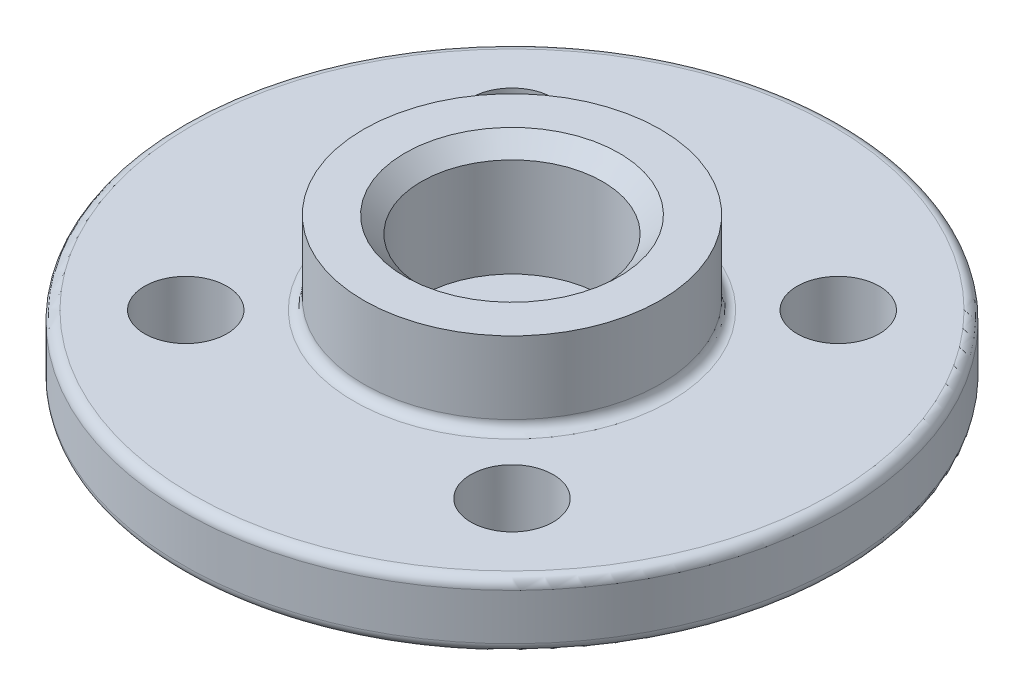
ISO-10303-21;
HEADER;
FILE_DESCRIPTION(('STEP AP214'),'2;1');
FILE_NAME('part.step','',(''),(''),'','','');
FILE_SCHEMA(('AUTOMOTIVE_DESIGN { 1 0 10303 214 1 1 1 1 }'));
ENDSEC;
DATA;
#1=APPLICATION_CONTEXT('core data for automotive mechanical design processes');
#2=APPLICATION_PROTOCOL_DEFINITION('international standard','automotive_design',2000,#1);
#3=PRODUCT_CONTEXT('',#1,'mechanical');
#4=PRODUCT('Part','Part','',(#3));
#5=PRODUCT_RELATED_PRODUCT_CATEGORY('part','',(#4));
#6=PRODUCT_DEFINITION_FORMATION('','',#4);
#7=PRODUCT_DEFINITION_CONTEXT('part definition',#1,'design');
#8=PRODUCT_DEFINITION('design','',#6,#7);
#9=PRODUCT_DEFINITION_SHAPE('','',#8);
#10=(LENGTH_UNIT() NAMED_UNIT(*) SI_UNIT(.MILLI.,.METRE.));
#11=(NAMED_UNIT(*) PLANE_ANGLE_UNIT() SI_UNIT($,.RADIAN.));
#12=(NAMED_UNIT(*) SI_UNIT($,.STERADIAN.) SOLID_ANGLE_UNIT());
#13=UNCERTAINTY_MEASURE_WITH_UNIT(LENGTH_MEASURE(1.E-05),#10,'distance_accuracy_value','');
#14=(GEOMETRIC_REPRESENTATION_CONTEXT(3) GLOBAL_UNCERTAINTY_ASSIGNED_CONTEXT((#13)) GLOBAL_UNIT_ASSIGNED_CONTEXT((#10,
#11,#12)) REPRESENTATION_CONTEXT('',''));
#15=CARTESIAN_POINT('',(0.,0.,0.));
#16=DIRECTION('',(0.,0.,1.));
#17=DIRECTION('',(1.,0.,0.));
#18=AXIS2_PLACEMENT_3D('',#15,#16,#17);
#19=CARTESIAN_POINT('',(0.,0.,0.));
#20=DIRECTION('',(0.,-1.,0.));
#21=DIRECTION('',(1.,0.,0.));
#22=AXIS2_PLACEMENT_3D('',#19,#20,#21);
#23=PLANE('',#22);
#24=CARTESIAN_POINT('',(0.,0.,0.));
#25=DIRECTION('',(0.,-1.,0.));
#26=DIRECTION('',(1.,0.,0.));
#27=AXIS2_PLACEMENT_3D('',#24,#25,#26);
#28=CIRCLE('',#27,9.7);
#29=CARTESIAN_POINT('',(9.7,0.,0.));
#30=VERTEX_POINT('',#29);
#31=EDGE_CURVE('E10',#30,#30,#28,.T.);
#32=ORIENTED_EDGE('',*,*,#31,.T.);
#33=EDGE_LOOP('',(#32));
#34=FACE_BOUND('',#33,.T.);
#35=CARTESIAN_POINT('',(4.94974746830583,0.,4.94974746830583));
#36=DIRECTION('',(0.,-1.,0.));
#37=DIRECTION('',(1.,0.,0.));
#38=AXIS2_PLACEMENT_3D('',#35,#36,#37);
#39=CIRCLE('',#38,1.45);
#40=CARTESIAN_POINT('',(6.39974746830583,0.,4.94974746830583));
#41=VERTEX_POINT('',#40);
#42=EDGE_CURVE('E87',#41,#41,#39,.F.);
#43=ORIENTED_EDGE('',*,*,#42,.T.);
#44=EDGE_LOOP('',(#43));
#45=FACE_BOUND('',#44,.T.);
#46=CARTESIAN_POINT('',(4.94974746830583,0.,-4.94974746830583));
#47=DIRECTION('',(0.,-1.,0.));
#48=DIRECTION('',(1.,0.,0.));
#49=AXIS2_PLACEMENT_3D('',#46,#47,#48);
#50=CIRCLE('',#49,1.45);
#51=CARTESIAN_POINT('',(6.39974746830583,0.,-4.94974746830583));
#52=VERTEX_POINT('',#51);
#53=EDGE_CURVE('E91',#52,#52,#50,.F.);
#54=ORIENTED_EDGE('',*,*,#53,.T.);
#55=EDGE_LOOP('',(#54));
#56=FACE_BOUND('',#55,.T.);
#57=CARTESIAN_POINT('',(-4.94974746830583,0.,4.94974746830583));
#58=DIRECTION('',(0.,-1.,0.));
#59=DIRECTION('',(1.,0.,0.));
#60=AXIS2_PLACEMENT_3D('',#57,#58,#59);
#61=CIRCLE('',#60,1.45);
#62=CARTESIAN_POINT('',(-3.49974746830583,0.,4.94974746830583));
#63=VERTEX_POINT('',#62);
#64=EDGE_CURVE('E95',#63,#63,#61,.F.);
#65=ORIENTED_EDGE('',*,*,#64,.T.);
#66=EDGE_LOOP('',(#65));
#67=FACE_BOUND('',#66,.T.);
#68=CARTESIAN_POINT('',(-4.94974746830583,0.,-4.94974746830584));
#69=DIRECTION('',(0.,-1.,0.));
#70=DIRECTION('',(1.,0.,0.));
#71=AXIS2_PLACEMENT_3D('',#68,#69,#70);
#72=CIRCLE('',#71,1.45);
#73=CARTESIAN_POINT('',(-3.49974746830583,0.,-4.94974746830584));
#74=VERTEX_POINT('',#73);
#75=EDGE_CURVE('E99',#74,#74,#72,.F.);
#76=ORIENTED_EDGE('',*,*,#75,.T.);
#77=EDGE_LOOP('',(#76));
#78=FACE_BOUND('',#77,.T.);
#79=CARTESIAN_POINT('',(0.,0.,0.));
#80=DIRECTION('',(0.,-1.,0.));
#81=DIRECTION('',(1.,0.,0.));
#82=AXIS2_PLACEMENT_3D('',#79,#80,#81);
#83=CIRCLE('',#82,1.5);
#84=CARTESIAN_POINT('',(1.5,0.,0.));
#85=VERTEX_POINT('',#84);
#86=EDGE_CURVE('E129',#85,#85,#83,.T.);
#87=ORIENTED_EDGE('',*,*,#86,.F.);
#88=EDGE_LOOP('',(#87));
#89=FACE_BOUND('',#88,.T.);
#90=ADVANCED_FACE('F43',(#34,#45,#56,#67,#78,#89),#23,.T.);
#91=CARTESIAN_POINT('',(0.,1.,0.));
#92=DIRECTION('',(0.,1.,0.));
#93=DIRECTION('',(-1.,0.,0.));
#94=AXIS2_PLACEMENT_3D('',#91,#92,#93);
#95=CYLINDRICAL_SURFACE('',#94,10.);
#96=CARTESIAN_POINT('',(0.,1.7,0.));
#97=DIRECTION('',(0.,1.,0.));
#98=DIRECTION('',(-1.,0.,0.));
#99=AXIS2_PLACEMENT_3D('',#96,#97,#98);
#100=CIRCLE('',#99,10.);
#101=CARTESIAN_POINT('',(-10.,1.7,0.));
#102=VERTEX_POINT('',#101);
#103=EDGE_CURVE('E51',#102,#102,#100,.F.);
#104=ORIENTED_EDGE('',*,*,#103,.T.);
#105=EDGE_LOOP('',(#104));
#106=FACE_BOUND('',#105,.T.);
#107=CARTESIAN_POINT('',(0.,0.3,0.));
#108=DIRECTION('',(0.,-1.,0.));
#109=DIRECTION('',(1.,0.,0.));
#110=AXIS2_PLACEMENT_3D('',#107,#108,#109);
#111=CIRCLE('',#110,10.);
#112=CARTESIAN_POINT('',(10.,0.299999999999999,0.));
#113=VERTEX_POINT('',#112);
#114=EDGE_CURVE('E56',#113,#113,#111,.F.);
#115=ORIENTED_EDGE('',*,*,#114,.T.);
#116=EDGE_LOOP('',(#115));
#117=FACE_BOUND('',#116,.T.);
#118=ADVANCED_FACE('F151',(#106,#117),#95,.T.);
#119=CARTESIAN_POINT('',(-10.,2.,0.));
#120=DIRECTION('',(0.,1.,0.));
#121=DIRECTION('',(-1.,0.,0.));
#122=AXIS2_PLACEMENT_3D('',#119,#120,#121);
#123=PLANE('',#122);
#124=CARTESIAN_POINT('',(0.,2.,0.));
#125=DIRECTION('',(0.,1.,0.));
#126=DIRECTION('',(-1.,0.,0.));
#127=AXIS2_PLACEMENT_3D('',#124,#125,#126);
#128=CIRCLE('',#127,4.8);
#129=CARTESIAN_POINT('',(-4.8,2.,0.));
#130=VERTEX_POINT('',#129);
#131=EDGE_CURVE('E61',#130,#130,#128,.F.);
#132=ORIENTED_EDGE('',*,*,#131,.T.);
#133=EDGE_LOOP('',(#132));
#134=FACE_BOUND('',#133,.T.);
#135=CARTESIAN_POINT('',(0.,2.,0.));
#136=DIRECTION('',(0.,1.,0.));
#137=DIRECTION('',(-1.,0.,0.));
#138=AXIS2_PLACEMENT_3D('',#135,#136,#137);
#139=CIRCLE('',#138,9.7);
#140=CARTESIAN_POINT('',(-9.7,2.,0.));
#141=VERTEX_POINT('',#140);
#142=EDGE_CURVE('E67',#141,#141,#139,.T.);
#143=ORIENTED_EDGE('',*,*,#142,.T.);
#144=EDGE_LOOP('',(#143));
#145=FACE_BOUND('',#144,.T.);
#146=CARTESIAN_POINT('',(-4.94974746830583,2.,-4.94974746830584));
#147=DIRECTION('',(0.,1.,0.));
#148=DIRECTION('',(-1.,0.,0.));
#149=AXIS2_PLACEMENT_3D('',#146,#147,#148);
#150=CIRCLE('',#149,1.25);
#151=CARTESIAN_POINT('',(-6.19974746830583,2.,-4.94974746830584));
#152=VERTEX_POINT('',#151);
#153=EDGE_CURVE('E108',#152,#152,#150,.T.);
#154=ORIENTED_EDGE('',*,*,#153,.F.);
#155=EDGE_LOOP('',(#154));
#156=FACE_BOUND('',#155,.T.);
#157=CARTESIAN_POINT('',(4.94974746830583,2.,-4.94974746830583));
#158=DIRECTION('',(0.,1.,0.));
#159=DIRECTION('',(-1.,0.,0.));
#160=AXIS2_PLACEMENT_3D('',#157,#158,#159);
#161=CIRCLE('',#160,1.25);
#162=CARTESIAN_POINT('',(3.69974746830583,2.,-4.94974746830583));
#163=VERTEX_POINT('',#162);
#164=EDGE_CURVE('E113',#163,#163,#161,.T.);
#165=ORIENTED_EDGE('',*,*,#164,.F.);
#166=EDGE_LOOP('',(#165));
#167=FACE_BOUND('',#166,.T.);
#168=CARTESIAN_POINT('',(4.94974746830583,2.,4.94974746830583));
#169=DIRECTION('',(0.,1.,0.));
#170=DIRECTION('',(-1.,0.,0.));
#171=AXIS2_PLACEMENT_3D('',#168,#169,#170);
#172=CIRCLE('',#171,1.25);
#173=CARTESIAN_POINT('',(3.69974746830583,2.,4.94974746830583));
#174=VERTEX_POINT('',#173);
#175=EDGE_CURVE('E117',#174,#174,#172,.T.);
#176=ORIENTED_EDGE('',*,*,#175,.F.);
#177=EDGE_LOOP('',(#176));
#178=FACE_BOUND('',#177,.T.);
#179=CARTESIAN_POINT('',(-4.94974746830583,2.,4.94974746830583));
#180=DIRECTION('',(0.,1.,0.));
#181=DIRECTION('',(-1.,0.,0.));
#182=AXIS2_PLACEMENT_3D('',#179,#180,#181);
#183=CIRCLE('',#182,1.25);
#184=CARTESIAN_POINT('',(-6.19974746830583,2.,4.94974746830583));
#185=VERTEX_POINT('',#184);
#186=EDGE_CURVE('E121',#185,#185,#183,.T.);
#187=ORIENTED_EDGE('',*,*,#186,.F.);
#188=EDGE_LOOP('',(#187));
#189=FACE_BOUND('',#188,.T.);
#190=ADVANCED_FACE('F156',(#134,#145,#156,#167,#178,#189),#123,.T.);
#191=CARTESIAN_POINT('',(0.,1.,0.));
#192=DIRECTION('',(0.,1.,0.));
#193=DIRECTION('',(-1.,0.,0.));
#194=AXIS2_PLACEMENT_3D('',#191,#192,#193);
#195=CYLINDRICAL_SURFACE('',#194,4.5);
#196=CARTESIAN_POINT('',(0.,2.3,0.));
#197=DIRECTION('',(0.,1.,0.));
#198=DIRECTION('',(-1.,0.,0.));
#199=AXIS2_PLACEMENT_3D('',#196,#197,#198);
#200=CIRCLE('',#199,4.5);
#201=CARTESIAN_POINT('',(-4.5,2.3,0.));
#202=VERTEX_POINT('',#201);
#203=EDGE_CURVE('E71',#202,#202,#200,.T.);
#204=ORIENTED_EDGE('',*,*,#203,.T.);
#205=EDGE_LOOP('',(#204));
#206=FACE_BOUND('',#205,.T.);
#207=CARTESIAN_POINT('',(0.,4.5,0.));
#208=DIRECTION('',(0.,1.,0.));
#209=DIRECTION('',(-1.,0.,0.));
#210=AXIS2_PLACEMENT_3D('',#207,#208,#209);
#211=CIRCLE('',#210,4.5);
#212=CARTESIAN_POINT('',(-4.5,4.5,0.));
#213=VERTEX_POINT('',#212);
#214=EDGE_CURVE('E137',#213,#213,#211,.T.);
#215=ORIENTED_EDGE('',*,*,#214,.F.);
#216=EDGE_LOOP('',(#215));
#217=FACE_BOUND('',#216,.T.);
#218=ADVANCED_FACE('F213',(#206,#217),#195,.T.);
#219=CARTESIAN_POINT('',(-4.5,4.5,0.));
#220=DIRECTION('',(0.,1.,0.));
#221=DIRECTION('',(-1.,0.,0.));
#222=AXIS2_PLACEMENT_3D('',#219,#220,#221);
#223=PLANE('',#222);
#224=CARTESIAN_POINT('',(0.,4.5,0.));
#225=DIRECTION('',(0.,1.,0.));
#226=DIRECTION('',(-1.,0.,0.));
#227=AXIS2_PLACEMENT_3D('',#224,#225,#226);
#228=CIRCLE('',#227,3.25);
#229=CARTESIAN_POINT('',(-3.25,4.5,0.));
#230=VERTEX_POINT('',#229);
#231=EDGE_CURVE('E107',#230,#230,#228,.F.);
#232=ORIENTED_EDGE('',*,*,#231,.T.);
#233=EDGE_LOOP('',(#232));
#234=FACE_BOUND('',#233,.T.);
#235=ORIENTED_EDGE('',*,*,#214,.T.);
#236=EDGE_LOOP('',(#235));
#237=FACE_BOUND('',#236,.T.);
#238=ADVANCED_FACE('F245',(#234,#237),#223,.T.);
#239=CARTESIAN_POINT('',(0.,1.,0.));
#240=DIRECTION('',(0.,1.,0.));
#241=DIRECTION('',(-1.,0.,0.));
#242=AXIS2_PLACEMENT_3D('',#239,#240,#241);
#243=CYLINDRICAL_SURFACE('',#242,2.75);
#244=CARTESIAN_POINT('',(0.,4.,0.));
#245=DIRECTION('',(0.,1.,0.));
#246=DIRECTION('',(-1.,0.,0.));
#247=AXIS2_PLACEMENT_3D('',#244,#245,#246);
#248=CIRCLE('',#247,2.75);
#249=CARTESIAN_POINT('',(-2.75,4.,0.));
#250=VERTEX_POINT('',#249);
#251=EDGE_CURVE('E133',#250,#250,#248,.T.);
#252=ORIENTED_EDGE('',*,*,#251,.T.);
#253=EDGE_LOOP('',(#252));
#254=FACE_BOUND('',#253,.T.);
#255=CARTESIAN_POINT('',(0.,1.,0.));
#256=DIRECTION('',(0.,1.,0.));
#257=DIRECTION('',(-1.,0.,0.));
#258=AXIS2_PLACEMENT_3D('',#255,#256,#257);
#259=CIRCLE('',#258,2.75);
#260=CARTESIAN_POINT('',(-2.75,1.,0.));
#261=VERTEX_POINT('',#260);
#262=EDGE_CURVE('E112',#261,#261,#259,.T.);
#263=ORIENTED_EDGE('',*,*,#262,.F.);
#264=EDGE_LOOP('',(#263));
#265=FACE_BOUND('',#264,.T.);
#266=ADVANCED_FACE('F241',(#254,#265),#243,.F.);
#267=CARTESIAN_POINT('',(-2.75,1.,0.));
#268=DIRECTION('',(0.,1.,0.));
#269=DIRECTION('',(-1.,0.,0.));
#270=AXIS2_PLACEMENT_3D('',#267,#268,#269);
#271=PLANE('',#270);
#272=CARTESIAN_POINT('',(0.,1.,0.));
#273=DIRECTION('',(0.,1.,0.));
#274=DIRECTION('',(-1.,0.,0.));
#275=AXIS2_PLACEMENT_3D('',#272,#273,#274);
#276=CIRCLE('',#275,1.5);
#277=CARTESIAN_POINT('',(-1.5,1.,0.));
#278=VERTEX_POINT('',#277);
#279=EDGE_CURVE('E125',#278,#278,#276,.T.);
#280=ORIENTED_EDGE('',*,*,#279,.F.);
#281=EDGE_LOOP('',(#280));
#282=FACE_BOUND('',#281,.T.);
#283=ORIENTED_EDGE('',*,*,#262,.T.);
#284=EDGE_LOOP('',(#283));
#285=FACE_BOUND('',#284,.T.);
#286=ADVANCED_FACE('F168',(#282,#285),#271,.T.);
#287=CARTESIAN_POINT('',(0.,4.,0.));
#288=DIRECTION('',(0.,1.,0.));
#289=DIRECTION('',(-1.,0.,0.));
#290=AXIS2_PLACEMENT_3D('',#287,#288,#289);
#291=CONICAL_SURFACE('',#290,2.75,0.785398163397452);
#292=ORIENTED_EDGE('',*,*,#231,.F.);
#293=EDGE_LOOP('',(#292));
#294=FACE_BOUND('',#293,.T.);
#295=ORIENTED_EDGE('',*,*,#251,.F.);
#296=EDGE_LOOP('',(#295));
#297=FACE_BOUND('',#296,.T.);
#298=ADVANCED_FACE('F162',(#294,#297),#291,.F.);
#299=CARTESIAN_POINT('',(0.,4.5,0.));
#300=DIRECTION('',(0.,-1.,0.));
#301=DIRECTION('',(1.,0.,0.));
#302=AXIS2_PLACEMENT_3D('',#299,#300,#301);
#303=CYLINDRICAL_SURFACE('',#302,1.5);
#304=ORIENTED_EDGE('',*,*,#279,.T.);
#305=EDGE_LOOP('',(#304));
#306=FACE_BOUND('',#305,.T.);
#307=ORIENTED_EDGE('',*,*,#86,.T.);
#308=EDGE_LOOP('',(#307));
#309=FACE_BOUND('',#308,.T.);
#310=ADVANCED_FACE('F148',(#306,#309),#303,.F.);
#311=CARTESIAN_POINT('',(-4.94974746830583,4.5,4.94974746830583));
#312=DIRECTION('',(0.,-1.,0.));
#313=DIRECTION('',(1.,0.,0.));
#314=AXIS2_PLACEMENT_3D('',#311,#312,#313);
#315=CYLINDRICAL_SURFACE('',#314,1.25);
#316=CARTESIAN_POINT('',(-4.94974746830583,0.199999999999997,4.94974746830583));
#317=DIRECTION('',(0.,-1.,0.));
#318=DIRECTION('',(0.,0.,-1.));
#319=AXIS2_PLACEMENT_3D('',#316,#317,#318);
#320=CIRCLE('',#319,1.25);
#321=CARTESIAN_POINT('',(-4.94974746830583,0.199999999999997,3.69974746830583));
#322=VERTEX_POINT('',#321);
#323=EDGE_CURVE('E79',#322,#322,#320,.T.);
#324=ORIENTED_EDGE('',*,*,#323,.T.);
#325=EDGE_LOOP('',(#324));
#326=FACE_BOUND('',#325,.T.);
#327=ORIENTED_EDGE('',*,*,#186,.T.);
#328=EDGE_LOOP('',(#327));
#329=FACE_BOUND('',#328,.T.);
#330=ADVANCED_FACE('F223',(#326,#329),#315,.F.);
#331=CARTESIAN_POINT('',(4.94974746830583,4.5,4.94974746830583));
#332=DIRECTION('',(0.,-1.,0.));
#333=DIRECTION('',(1.,0.,0.));
#334=AXIS2_PLACEMENT_3D('',#331,#332,#333);
#335=CYLINDRICAL_SURFACE('',#334,1.25);
#336=CARTESIAN_POINT('',(4.94974746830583,0.199999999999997,4.94974746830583));
#337=DIRECTION('',(0.,-1.,0.));
#338=DIRECTION('',(0.,0.,-1.));
#339=AXIS2_PLACEMENT_3D('',#336,#337,#338);
#340=CIRCLE('',#339,1.25);
#341=CARTESIAN_POINT('',(4.94974746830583,0.199999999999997,3.69974746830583));
#342=VERTEX_POINT('',#341);
#343=EDGE_CURVE('E103',#342,#342,#340,.T.);
#344=ORIENTED_EDGE('',*,*,#343,.T.);
#345=EDGE_LOOP('',(#344));
#346=FACE_BOUND('',#345,.T.);
#347=ORIENTED_EDGE('',*,*,#175,.T.);
#348=EDGE_LOOP('',(#347));
#349=FACE_BOUND('',#348,.T.);
#350=ADVANCED_FACE('F225',(#346,#349),#335,.F.);
#351=CARTESIAN_POINT('',(4.94974746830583,4.5,-4.94974746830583));
#352=DIRECTION('',(0.,-1.,0.));
#353=DIRECTION('',(1.,0.,0.));
#354=AXIS2_PLACEMENT_3D('',#351,#352,#353);
#355=CYLINDRICAL_SURFACE('',#354,1.25);
#356=CARTESIAN_POINT('',(4.94974746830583,0.199999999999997,-4.94974746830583));
#357=DIRECTION('',(0.,-1.,0.));
#358=DIRECTION('',(0.,0.,-1.));
#359=AXIS2_PLACEMENT_3D('',#356,#357,#358);
#360=CIRCLE('',#359,1.25);
#361=CARTESIAN_POINT('',(4.94974746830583,0.199999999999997,-6.19974746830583));
#362=VERTEX_POINT('',#361);
#363=EDGE_CURVE('E83',#362,#362,#360,.T.);
#364=ORIENTED_EDGE('',*,*,#363,.T.);
#365=EDGE_LOOP('',(#364));
#366=FACE_BOUND('',#365,.T.);
#367=ORIENTED_EDGE('',*,*,#164,.T.);
#368=EDGE_LOOP('',(#367));
#369=FACE_BOUND('',#368,.T.);
#370=ADVANCED_FACE('F232',(#366,#369),#355,.F.);
#371=CARTESIAN_POINT('',(-4.94974746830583,4.5,-4.94974746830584));
#372=DIRECTION('',(0.,-1.,0.));
#373=DIRECTION('',(1.,0.,0.));
#374=AXIS2_PLACEMENT_3D('',#371,#372,#373);
#375=CYLINDRICAL_SURFACE('',#374,1.25);
#376=CARTESIAN_POINT('',(-4.94974746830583,0.199999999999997,-4.94974746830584));
#377=DIRECTION('',(0.,-1.,0.));
#378=DIRECTION('',(0.,0.,-1.));
#379=AXIS2_PLACEMENT_3D('',#376,#377,#378);
#380=CIRCLE('',#379,1.25);
#381=CARTESIAN_POINT('',(-4.94974746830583,0.199999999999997,-6.19974746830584));
#382=VERTEX_POINT('',#381);
#383=EDGE_CURVE('E75',#382,#382,#380,.T.);
#384=ORIENTED_EDGE('',*,*,#383,.T.);
#385=EDGE_LOOP('',(#384));
#386=FACE_BOUND('',#385,.T.);
#387=ORIENTED_EDGE('',*,*,#153,.T.);
#388=EDGE_LOOP('',(#387));
#389=FACE_BOUND('',#388,.T.);
#390=ADVANCED_FACE('F177',(#386,#389),#375,.F.);
#391=CARTESIAN_POINT('',(4.94974746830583,0.199999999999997,4.94974746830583));
#392=DIRECTION('',(0.,-1.,0.));
#393=DIRECTION('',(0.,0.,-1.));
#394=AXIS2_PLACEMENT_3D('',#391,#392,#393);
#395=CONICAL_SURFACE('',#394,1.25,0.785398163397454);
#396=ORIENTED_EDGE('',*,*,#42,.F.);
#397=EDGE_LOOP('',(#396));
#398=FACE_BOUND('',#397,.T.);
#399=ORIENTED_EDGE('',*,*,#343,.F.);
#400=EDGE_LOOP('',(#399));
#401=FACE_BOUND('',#400,.T.);
#402=ADVANCED_FACE('F170',(#398,#401),#395,.F.);
#403=CARTESIAN_POINT('',(4.94974746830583,0.199999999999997,-4.94974746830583));
#404=DIRECTION('',(0.,-1.,0.));
#405=DIRECTION('',(0.,0.,-1.));
#406=AXIS2_PLACEMENT_3D('',#403,#404,#405);
#407=CONICAL_SURFACE('',#406,1.25,0.785398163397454);
#408=ORIENTED_EDGE('',*,*,#53,.F.);
#409=EDGE_LOOP('',(#408));
#410=FACE_BOUND('',#409,.T.);
#411=ORIENTED_EDGE('',*,*,#363,.F.);
#412=EDGE_LOOP('',(#411));
#413=FACE_BOUND('',#412,.T.);
#414=ADVANCED_FACE('F176',(#410,#413),#407,.F.);
#415=CARTESIAN_POINT('',(-4.94974746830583,0.199999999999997,4.94974746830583));
#416=DIRECTION('',(0.,-1.,0.));
#417=DIRECTION('',(0.,0.,-1.));
#418=AXIS2_PLACEMENT_3D('',#415,#416,#417);
#419=CONICAL_SURFACE('',#418,1.25,0.785398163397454);
#420=ORIENTED_EDGE('',*,*,#64,.F.);
#421=EDGE_LOOP('',(#420));
#422=FACE_BOUND('',#421,.T.);
#423=ORIENTED_EDGE('',*,*,#323,.F.);
#424=EDGE_LOOP('',(#423));
#425=FACE_BOUND('',#424,.T.);
#426=ADVANCED_FACE('F184',(#422,#425),#419,.F.);
#427=CARTESIAN_POINT('',(-4.94974746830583,0.199999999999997,-4.94974746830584));
#428=DIRECTION('',(0.,-1.,0.));
#429=DIRECTION('',(0.,0.,-1.));
#430=AXIS2_PLACEMENT_3D('',#427,#428,#429);
#431=CONICAL_SURFACE('',#430,1.25,0.785398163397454);
#432=ORIENTED_EDGE('',*,*,#75,.F.);
#433=EDGE_LOOP('',(#432));
#434=FACE_BOUND('',#433,.T.);
#435=ORIENTED_EDGE('',*,*,#383,.F.);
#436=EDGE_LOOP('',(#435));
#437=FACE_BOUND('',#436,.T.);
#438=ADVANCED_FACE('F191',(#434,#437),#431,.F.);
#439=CARTESIAN_POINT('',(0.,2.3,0.));
#440=DIRECTION('',(0.,1.,0.));
#441=DIRECTION('',(-1.,0.,0.));
#442=AXIS2_PLACEMENT_3D('',#439,#440,#441);
#443=TOROIDAL_SURFACE('',#442,4.8,0.3);
#444=ORIENTED_EDGE('',*,*,#131,.F.);
#445=EDGE_LOOP('',(#444));
#446=FACE_BOUND('',#445,.T.);
#447=ORIENTED_EDGE('',*,*,#203,.F.);
#448=EDGE_LOOP('',(#447));
#449=FACE_BOUND('',#448,.T.);
#450=ADVANCED_FACE('F197',(#446,#449),#443,.F.);
#451=CARTESIAN_POINT('',(0.,1.7,0.));
#452=DIRECTION('',(0.,1.,0.));
#453=DIRECTION('',(-1.,0.,0.));
#454=AXIS2_PLACEMENT_3D('',#451,#452,#453);
#455=TOROIDAL_SURFACE('',#454,9.7,0.3);
#456=ORIENTED_EDGE('',*,*,#103,.F.);
#457=EDGE_LOOP('',(#456));
#458=FACE_BOUND('',#457,.T.);
#459=ORIENTED_EDGE('',*,*,#142,.F.);
#460=EDGE_LOOP('',(#459));
#461=FACE_BOUND('',#460,.T.);
#462=ADVANCED_FACE('F200',(#458,#461),#455,.T.);
#463=CARTESIAN_POINT('',(0.,0.3,0.));
#464=DIRECTION('',(0.,-1.,0.));
#465=DIRECTION('',(1.,0.,0.));
#466=AXIS2_PLACEMENT_3D('',#463,#464,#465);
#467=TOROIDAL_SURFACE('',#466,9.7,0.3);
#468=ORIENTED_EDGE('',*,*,#31,.F.);
#469=EDGE_LOOP('',(#468));
#470=FACE_BOUND('',#469,.T.);
#471=ORIENTED_EDGE('',*,*,#114,.F.);
#472=EDGE_LOOP('',(#471));
#473=FACE_BOUND('',#472,.T.);
#474=ADVANCED_FACE('F45',(#470,#473),#467,.T.);
#475=CLOSED_SHELL('',(#90,#118,#190,#218,#238,#266,#286,#298,#310,#330,#350,#370,#390,#402,#414,
#426,#438,#450,#462,#474));
#476=MANIFOLD_SOLID_BREP('B2',#475);
#477=ADVANCED_BREP_SHAPE_REPRESENTATION('',(#18,#476),#14);
#478=SHAPE_DEFINITION_REPRESENTATION(#9,#477);
ENDSEC;
END-ISO-10303-21;
